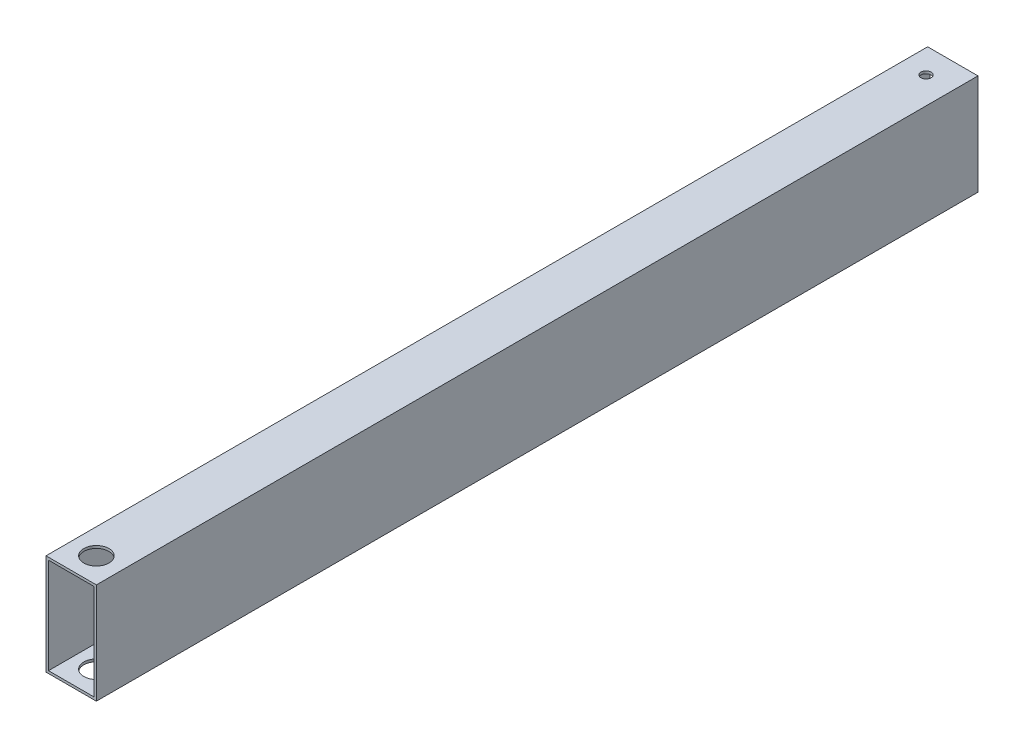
from build123d import *

# Parameters (mm, degrees)
ESQUISSE1_W      = 40
ESQUISSE1_H      = 80
ESQUISSE1_W_2    = 36
ESQUISSE1_H_2    = 76
EXTRUSION1_DEPTH = 700
ESQUISSE2_R      = 10
EXTRUSION2_DEPTH = 706.691150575
ESQUISSE3_R      = 4
EXTRUSION3_DEPTH = 706.691150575


with BuildPart() as part:
    # Esquisse1 → Extrusion1 (new body)
    with BuildSketch(Plane.XY):
        with Locations((20, 40)):
            Rectangle(ESQUISSE1_W, ESQUISSE1_H)
        with Locations((20, 40)):
            Rectangle(ESQUISSE1_W_2, ESQUISSE1_H_2, mode=Mode.SUBTRACT)
    extrude(amount=EXTRUSION1_DEPTH)

    # Esquisse2 → Extrusion2 (cut, through all)
    with BuildSketch(Plane(origin=(0, 80, 0), x_dir=(1, 0, 0), z_dir=(0, 1, 0))):
        with Locations(Location((20, -680, 0), (0, 0, 270))):
            Circle(ESQUISSE2_R)
    extrude(amount=-EXTRUSION2_DEPTH, mode=Mode.SUBTRACT)

    # Esquisse3 → Extrusion3 (cut, through all)
    with BuildSketch(Plane(origin=(0, 80, 0), x_dir=(1, 0, 0), z_dir=(0, 1, 0))):
        with Locations(Location((18.735693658, -20, 0), (0, 0, 270))):
            Circle(ESQUISSE3_R)
    extrude(amount=-EXTRUSION3_DEPTH, mode=Mode.SUBTRACT)


solid = part.part
